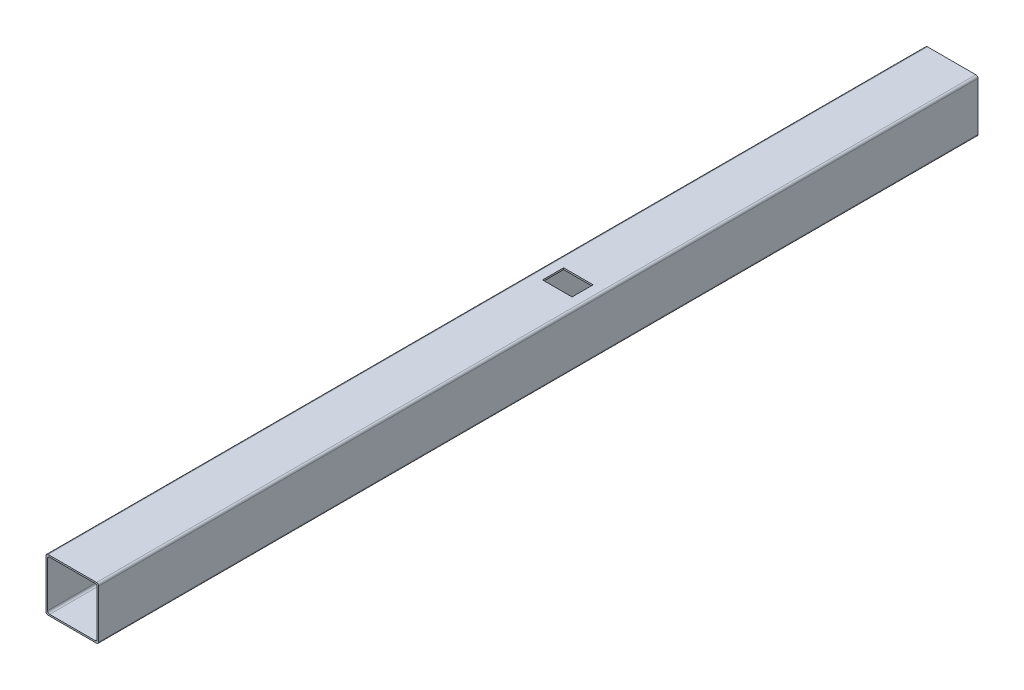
ISO-10303-21;
HEADER;
FILE_DESCRIPTION(('STEP AP214'),'2;1');
FILE_NAME('part.step','',(''),(''),'','','');
FILE_SCHEMA(('AUTOMOTIVE_DESIGN { 1 0 10303 214 1 1 1 1 }'));
ENDSEC;
DATA;
#1=APPLICATION_CONTEXT('core data for automotive mechanical design processes');
#2=APPLICATION_PROTOCOL_DEFINITION('international standard','automotive_design',2000,#1);
#3=PRODUCT_CONTEXT('',#1,'mechanical');
#4=PRODUCT('Part','Part','',(#3));
#5=PRODUCT_RELATED_PRODUCT_CATEGORY('part','',(#4));
#6=PRODUCT_DEFINITION_FORMATION('','',#4);
#7=PRODUCT_DEFINITION_CONTEXT('part definition',#1,'design');
#8=PRODUCT_DEFINITION('design','',#6,#7);
#9=PRODUCT_DEFINITION_SHAPE('','',#8);
#10=(LENGTH_UNIT() NAMED_UNIT(*) SI_UNIT(.MILLI.,.METRE.));
#11=(NAMED_UNIT(*) PLANE_ANGLE_UNIT() SI_UNIT($,.RADIAN.));
#12=(NAMED_UNIT(*) SI_UNIT($,.STERADIAN.) SOLID_ANGLE_UNIT());
#13=UNCERTAINTY_MEASURE_WITH_UNIT(LENGTH_MEASURE(1.E-05),#10,'distance_accuracy_value','');
#14=(GEOMETRIC_REPRESENTATION_CONTEXT(3) GLOBAL_UNCERTAINTY_ASSIGNED_CONTEXT((#13)) GLOBAL_UNIT_ASSIGNED_CONTEXT((#10,
#11,#12)) REPRESENTATION_CONTEXT('',''));
#15=CARTESIAN_POINT('',(0.,0.,0.));
#16=DIRECTION('',(0.,0.,1.));
#17=DIRECTION('',(1.,0.,0.));
#18=AXIS2_PLACEMENT_3D('',#15,#16,#17);
#19=CARTESIAN_POINT('',(0.,3.,1670.));
#20=DIRECTION('',(0.,1.,0.));
#21=DIRECTION('',(0.,0.,1.));
#22=AXIS2_PLACEMENT_3D('',#19,#20,#21);
#23=PLANE('',#22);
#24=DIRECTION('',(0.,0.,-1.));
#25=VECTOR('',#24,1.);
#26=CARTESIAN_POINT('',(7.,3.,1670.));
#27=LINE('',#26,#25);
#28=CARTESIAN_POINT('',(7.,3.,0.));
#29=VERTEX_POINT('',#28);
#30=CARTESIAN_POINT('',(7.00000000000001,3.,600.));
#31=VERTEX_POINT('',#30);
#32=EDGE_CURVE('E513',#29,#31,#27,.F.);
#33=ORIENTED_EDGE('',*,*,#32,.T.);
#34=DIRECTION('',(-1.,0.,0.));
#35=VECTOR('',#34,1.);
#36=CARTESIAN_POINT('',(95.,3.,600.));
#37=LINE('',#36,#35);
#38=CARTESIAN_POINT('',(93.,3.,600.));
#39=VERTEX_POINT('',#38);
#40=EDGE_CURVE('E346',#39,#31,#37,.T.);
#41=ORIENTED_EDGE('',*,*,#40,.F.);
#42=DIRECTION('',(0.,0.,-1.));
#43=VECTOR('',#42,1.);
#44=CARTESIAN_POINT('',(93.,3.,0.));
#45=LINE('',#44,#43);
#46=CARTESIAN_POINT('',(93.,3.,0.));
#47=VERTEX_POINT('',#46);
#48=EDGE_CURVE('E507',#39,#47,#45,.T.);
#49=ORIENTED_EDGE('',*,*,#48,.T.);
#50=DIRECTION('',(1.,0.,0.));
#51=VECTOR('',#50,1.);
#52=CARTESIAN_POINT('',(0.,3.,0.));
#53=LINE('',#52,#51);
#54=EDGE_CURVE('E409',#29,#47,#53,.T.);
#55=ORIENTED_EDGE('',*,*,#54,.F.);
#56=EDGE_LOOP('',(#33,#41,#49,#55));
#57=FACE_BOUND('',#56,.T.);
#58=ADVANCED_FACE('F66',(#57),#23,.T.);
#59=CARTESIAN_POINT('',(7.,7.00000000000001,1670.));
#60=DIRECTION('',(0.,0.,1.));
#61=DIRECTION('',(1.,0.,0.));
#62=AXIS2_PLACEMENT_3D('',#59,#60,#61);
#63=CYLINDRICAL_SURFACE('',#62,4.);
#64=CARTESIAN_POINT('',(7.,7.00000000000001,600.));
#65=DIRECTION('',(0.,0.,1.));
#66=DIRECTION('',(1.,0.,0.));
#67=AXIS2_PLACEMENT_3D('',#64,#65,#66);
#68=CIRCLE('',#67,4.);
#69=CARTESIAN_POINT('',(5.,3.53589838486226,600.));
#70=VERTEX_POINT('',#69);
#71=EDGE_CURVE('E342',#70,#31,#68,.T.);
#72=ORIENTED_EDGE('',*,*,#71,.T.);
#73=ORIENTED_EDGE('',*,*,#32,.F.);
#74=CARTESIAN_POINT('',(7.,7.00000000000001,0.));
#75=DIRECTION('',(0.,0.,1.));
#76=DIRECTION('',(1.,0.,0.));
#77=AXIS2_PLACEMENT_3D('',#74,#75,#76);
#78=CIRCLE('',#77,4.);
#79=CARTESIAN_POINT('',(3.,7.00000000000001,0.));
#80=VERTEX_POINT('',#79);
#81=EDGE_CURVE('E531',#80,#29,#78,.T.);
#82=ORIENTED_EDGE('',*,*,#81,.F.);
#83=DIRECTION('',(0.,0.,-1.));
#84=VECTOR('',#83,1.);
#85=CARTESIAN_POINT('',(3.,7.00000000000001,0.));
#86=LINE('',#85,#84);
#87=CARTESIAN_POINT('',(3.,7.00000000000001,1670.));
#88=VERTEX_POINT('',#87);
#89=EDGE_CURVE('E503',#88,#80,#86,.T.);
#90=ORIENTED_EDGE('',*,*,#89,.F.);
#91=CARTESIAN_POINT('',(7.,7.00000000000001,1670.));
#92=DIRECTION('',(0.,0.,1.));
#93=DIRECTION('',(1.,0.,0.));
#94=AXIS2_PLACEMENT_3D('',#91,#92,#93);
#95=CIRCLE('',#94,4.);
#96=CARTESIAN_POINT('',(7.,3.,1670.));
#97=VERTEX_POINT('',#96);
#98=EDGE_CURVE('E534',#97,#88,#95,.F.);
#99=ORIENTED_EDGE('',*,*,#98,.F.);
#100=CARTESIAN_POINT('',(7.00000000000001,3.,750.));
#101=VERTEX_POINT('',#100);
#102=EDGE_CURVE('E512',#101,#97,#27,.F.);
#103=ORIENTED_EDGE('',*,*,#102,.F.);
#104=CARTESIAN_POINT('',(7.,7.00000000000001,750.));
#105=DIRECTION('',(0.,0.,1.));
#106=DIRECTION('',(1.,0.,0.));
#107=AXIS2_PLACEMENT_3D('',#104,#105,#106);
#108=CIRCLE('',#107,4.);
#109=CARTESIAN_POINT('',(5.,3.53589838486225,750.));
#110=VERTEX_POINT('',#109);
#111=EDGE_CURVE('E385',#110,#101,#108,.T.);
#112=ORIENTED_EDGE('',*,*,#111,.F.);
#113=DIRECTION('',(0.,0.,1.));
#114=VECTOR('',#113,1.);
#115=CARTESIAN_POINT('',(4.99999999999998,3.53589838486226,1670.));
#116=LINE('',#115,#114);
#117=EDGE_CURVE('E338',#110,#70,#116,.F.);
#118=ORIENTED_EDGE('',*,*,#117,.T.);
#119=EDGE_LOOP('',(#72,#73,#82,#90,#99,#103,#112,#118));
#120=FACE_BOUND('',#119,.T.);
#121=ADVANCED_FACE('F588',(#120),#63,.F.);
#122=CARTESIAN_POINT('',(93.,7.,1670.));
#123=DIRECTION('',(0.,0.,1.));
#124=DIRECTION('',(1.,0.,0.));
#125=AXIS2_PLACEMENT_3D('',#122,#123,#124);
#126=CYLINDRICAL_SURFACE('',#125,4.);
#127=CARTESIAN_POINT('',(93.,7.,600.));
#128=DIRECTION('',(0.,0.,1.));
#129=DIRECTION('',(1.,0.,0.));
#130=AXIS2_PLACEMENT_3D('',#127,#128,#129);
#131=CIRCLE('',#130,4.);
#132=CARTESIAN_POINT('',(95.,3.53589838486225,600.));
#133=VERTEX_POINT('',#132);
#134=EDGE_CURVE('E334',#39,#133,#131,.T.);
#135=ORIENTED_EDGE('',*,*,#134,.T.);
#136=DIRECTION('',(0.,0.,1.));
#137=VECTOR('',#136,1.);
#138=CARTESIAN_POINT('',(95.,3.53589838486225,1670.));
#139=LINE('',#138,#137);
#140=CARTESIAN_POINT('',(95.,3.53589838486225,750.));
#141=VERTEX_POINT('',#140);
#142=EDGE_CURVE('E330',#141,#133,#139,.F.);
#143=ORIENTED_EDGE('',*,*,#142,.F.);
#144=CARTESIAN_POINT('',(93.,7.,750.));
#145=DIRECTION('',(0.,0.,1.));
#146=DIRECTION('',(1.,0.,0.));
#147=AXIS2_PLACEMENT_3D('',#144,#145,#146);
#148=CIRCLE('',#147,4.);
#149=CARTESIAN_POINT('',(93.,3.,750.));
#150=VERTEX_POINT('',#149);
#151=EDGE_CURVE('E368',#150,#141,#148,.T.);
#152=ORIENTED_EDGE('',*,*,#151,.F.);
#153=CARTESIAN_POINT('',(93.,3.,1670.));
#154=VERTEX_POINT('',#153);
#155=EDGE_CURVE('E508',#154,#150,#45,.T.);
#156=ORIENTED_EDGE('',*,*,#155,.F.);
#157=CARTESIAN_POINT('',(93.,7.,1670.));
#158=DIRECTION('',(0.,0.,1.));
#159=DIRECTION('',(1.,0.,0.));
#160=AXIS2_PLACEMENT_3D('',#157,#158,#159);
#161=CIRCLE('',#160,4.);
#162=CARTESIAN_POINT('',(97.,7.00000000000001,1670.));
#163=VERTEX_POINT('',#162);
#164=EDGE_CURVE('E539',#163,#154,#161,.F.);
#165=ORIENTED_EDGE('',*,*,#164,.F.);
#166=DIRECTION('',(0.,0.,-1.));
#167=VECTOR('',#166,1.);
#168=CARTESIAN_POINT('',(97.,7.,1670.));
#169=LINE('',#168,#167);
#170=CARTESIAN_POINT('',(97.,7.00000000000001,0.));
#171=VERTEX_POINT('',#170);
#172=EDGE_CURVE('E521',#171,#163,#169,.F.);
#173=ORIENTED_EDGE('',*,*,#172,.F.);
#174=CARTESIAN_POINT('',(93.,7.,0.));
#175=DIRECTION('',(0.,0.,1.));
#176=DIRECTION('',(1.,0.,0.));
#177=AXIS2_PLACEMENT_3D('',#174,#175,#176);
#178=CIRCLE('',#177,4.);
#179=EDGE_CURVE('E536',#47,#171,#178,.T.);
#180=ORIENTED_EDGE('',*,*,#179,.F.);
#181=ORIENTED_EDGE('',*,*,#48,.F.);
#182=EDGE_LOOP('',(#135,#143,#152,#156,#165,#173,#180,#181));
#183=FACE_BOUND('',#182,.T.);
#184=ADVANCED_FACE('F577',(#183),#126,.F.);
#185=CARTESIAN_POINT('',(0.,0.,1670.));
#186=DIRECTION('',(0.,0.,1.));
#187=DIRECTION('',(1.,0.,0.));
#188=AXIS2_PLACEMENT_3D('',#185,#186,#187);
#189=PLANE('',#188);
#190=DIRECTION('',(1.,0.,0.));
#191=VECTOR('',#190,1.);
#192=CARTESIAN_POINT('',(0.,0.,1670.));
#193=LINE('',#192,#191);
#194=CARTESIAN_POINT('',(4.,0.,1670.));
#195=VERTEX_POINT('',#194);
#196=CARTESIAN_POINT('',(96.,0.,1670.));
#197=VERTEX_POINT('',#196);
#198=EDGE_CURVE('E423',#195,#197,#193,.T.);
#199=ORIENTED_EDGE('',*,*,#198,.T.);
#200=CARTESIAN_POINT('',(96.,4.,1670.));
#201=DIRECTION('',(0.,0.,1.));
#202=DIRECTION('',(1.,0.,0.));
#203=AXIS2_PLACEMENT_3D('',#200,#201,#202);
#204=CIRCLE('',#203,4.);
#205=CARTESIAN_POINT('',(100.,4.,1670.));
#206=VERTEX_POINT('',#205);
#207=EDGE_CURVE('E483',#197,#206,#204,.T.);
#208=ORIENTED_EDGE('',*,*,#207,.T.);
#209=DIRECTION('',(0.,1.,0.));
#210=VECTOR('',#209,1.);
#211=CARTESIAN_POINT('',(100.,0.,1670.));
#212=LINE('',#211,#210);
#213=CARTESIAN_POINT('',(100.,96.,1670.));
#214=VERTEX_POINT('',#213);
#215=EDGE_CURVE('E428',#206,#214,#212,.T.);
#216=ORIENTED_EDGE('',*,*,#215,.T.);
#217=CARTESIAN_POINT('',(96.,96.,1670.));
#218=DIRECTION('',(0.,0.,1.));
#219=DIRECTION('',(1.,0.,0.));
#220=AXIS2_PLACEMENT_3D('',#217,#218,#219);
#221=CIRCLE('',#220,4.);
#222=CARTESIAN_POINT('',(96.,100.,1670.));
#223=VERTEX_POINT('',#222);
#224=EDGE_CURVE('E476',#214,#223,#221,.T.);
#225=ORIENTED_EDGE('',*,*,#224,.T.);
#226=DIRECTION('',(-1.,0.,0.));
#227=VECTOR('',#226,1.);
#228=CARTESIAN_POINT('',(0.,100.,1670.));
#229=LINE('',#228,#227);
#230=CARTESIAN_POINT('',(4.,100.,1670.));
#231=VERTEX_POINT('',#230);
#232=EDGE_CURVE('E432',#223,#231,#229,.T.);
#233=ORIENTED_EDGE('',*,*,#232,.T.);
#234=CARTESIAN_POINT('',(4.,96.,1670.));
#235=DIRECTION('',(0.,0.,1.));
#236=DIRECTION('',(1.,0.,0.));
#237=AXIS2_PLACEMENT_3D('',#234,#235,#236);
#238=CIRCLE('',#237,4.);
#239=CARTESIAN_POINT('',(0.,96.,1670.));
#240=VERTEX_POINT('',#239);
#241=EDGE_CURVE('E479',#231,#240,#238,.T.);
#242=ORIENTED_EDGE('',*,*,#241,.T.);
#243=DIRECTION('',(0.,-1.,0.));
#244=VECTOR('',#243,1.);
#245=CARTESIAN_POINT('',(0.,0.,1670.));
#246=LINE('',#245,#244);
#247=CARTESIAN_POINT('',(0.,4.,1670.));
#248=VERTEX_POINT('',#247);
#249=EDGE_CURVE('E420',#240,#248,#246,.T.);
#250=ORIENTED_EDGE('',*,*,#249,.T.);
#251=CARTESIAN_POINT('',(4.,4.,1670.));
#252=DIRECTION('',(0.,0.,1.));
#253=DIRECTION('',(1.,0.,0.));
#254=AXIS2_PLACEMENT_3D('',#251,#252,#253);
#255=CIRCLE('',#254,4.);
#256=EDGE_CURVE('E481',#248,#195,#255,.T.);
#257=ORIENTED_EDGE('',*,*,#256,.T.);
#258=EDGE_LOOP('',(#199,#208,#216,#225,#233,#242,#250,#257));
#259=FACE_BOUND('',#258,.T.);
#260=DIRECTION('',(1.,0.,0.));
#261=VECTOR('',#260,1.);
#262=CARTESIAN_POINT('',(0.,3.,1670.));
#263=LINE('',#262,#261);
#264=EDGE_CURVE('E392',#97,#154,#263,.T.);
#265=ORIENTED_EDGE('',*,*,#264,.F.);
#266=ORIENTED_EDGE('',*,*,#98,.T.);
#267=DIRECTION('',(0.,-1.,0.));
#268=VECTOR('',#267,1.);
#269=CARTESIAN_POINT('',(3.,100.,1670.));
#270=LINE('',#269,#268);
#271=CARTESIAN_POINT('',(3.,93.,1670.));
#272=VERTEX_POINT('',#271);
#273=EDGE_CURVE('E389',#272,#88,#270,.T.);
#274=ORIENTED_EDGE('',*,*,#273,.F.);
#275=CARTESIAN_POINT('',(7.,93.,1670.));
#276=DIRECTION('',(0.,0.,1.));
#277=DIRECTION('',(1.,0.,0.));
#278=AXIS2_PLACEMENT_3D('',#275,#276,#277);
#279=CIRCLE('',#278,4.);
#280=CARTESIAN_POINT('',(7.,97.,1670.));
#281=VERTEX_POINT('',#280);
#282=EDGE_CURVE('E12',#272,#281,#279,.F.);
#283=ORIENTED_EDGE('',*,*,#282,.T.);
#284=DIRECTION('',(-1.,0.,0.));
#285=VECTOR('',#284,1.);
#286=CARTESIAN_POINT('',(0.,97.,1670.));
#287=LINE('',#286,#285);
#288=CARTESIAN_POINT('',(93.,97.,1670.));
#289=VERTEX_POINT('',#288);
#290=EDGE_CURVE('E401',#289,#281,#287,.T.);
#291=ORIENTED_EDGE('',*,*,#290,.F.);
#292=CARTESIAN_POINT('',(93.,93.,1670.));
#293=DIRECTION('',(0.,0.,1.));
#294=DIRECTION('',(1.,0.,0.));
#295=AXIS2_PLACEMENT_3D('',#292,#293,#294);
#296=CIRCLE('',#295,4.);
#297=CARTESIAN_POINT('',(97.,93.,1670.));
#298=VERTEX_POINT('',#297);
#299=EDGE_CURVE('E545',#289,#298,#296,.F.);
#300=ORIENTED_EDGE('',*,*,#299,.T.);
#301=DIRECTION('',(0.,1.,0.));
#302=VECTOR('',#301,1.);
#303=CARTESIAN_POINT('',(97.,100.,1670.));
#304=LINE('',#303,#302);
#305=EDGE_CURVE('E397',#163,#298,#304,.T.);
#306=ORIENTED_EDGE('',*,*,#305,.F.);
#307=ORIENTED_EDGE('',*,*,#164,.T.);
#308=EDGE_LOOP('',(#265,#266,#274,#283,#291,#300,#306,#307));
#309=FACE_BOUND('',#308,.T.);
#310=ADVANCED_FACE('F563',(#259,#309),#189,.T.);
#311=CARTESIAN_POINT('',(0.,0.,0.));
#312=DIRECTION('',(0.,0.,1.));
#313=DIRECTION('',(1.,0.,0.));
#314=AXIS2_PLACEMENT_3D('',#311,#312,#313);
#315=PLANE('',#314);
#316=DIRECTION('',(0.,1.,0.));
#317=VECTOR('',#316,1.);
#318=CARTESIAN_POINT('',(100.,0.,0.));
#319=LINE('',#318,#317);
#320=CARTESIAN_POINT('',(100.,4.,0.));
#321=VERTEX_POINT('',#320);
#322=CARTESIAN_POINT('',(100.,96.,0.));
#323=VERTEX_POINT('',#322);
#324=EDGE_CURVE('E444',#321,#323,#319,.T.);
#325=ORIENTED_EDGE('',*,*,#324,.F.);
#326=CARTESIAN_POINT('',(96.,4.,0.));
#327=DIRECTION('',(0.,0.,1.));
#328=DIRECTION('',(1.,0.,0.));
#329=AXIS2_PLACEMENT_3D('',#326,#327,#328);
#330=CIRCLE('',#329,4.);
#331=CARTESIAN_POINT('',(96.,0.,0.));
#332=VERTEX_POINT('',#331);
#333=EDGE_CURVE('E466',#321,#332,#330,.F.);
#334=ORIENTED_EDGE('',*,*,#333,.T.);
#335=DIRECTION('',(1.,0.,0.));
#336=VECTOR('',#335,1.);
#337=CARTESIAN_POINT('',(0.,0.,0.));
#338=LINE('',#337,#336);
#339=CARTESIAN_POINT('',(4.,0.,0.));
#340=VERTEX_POINT('',#339);
#341=EDGE_CURVE('E440',#340,#332,#338,.T.);
#342=ORIENTED_EDGE('',*,*,#341,.F.);
#343=CARTESIAN_POINT('',(4.,4.,0.));
#344=DIRECTION('',(0.,0.,1.));
#345=DIRECTION('',(1.,0.,0.));
#346=AXIS2_PLACEMENT_3D('',#343,#344,#345);
#347=CIRCLE('',#346,4.);
#348=CARTESIAN_POINT('',(0.,4.,0.));
#349=VERTEX_POINT('',#348);
#350=EDGE_CURVE('E463',#340,#349,#347,.F.);
#351=ORIENTED_EDGE('',*,*,#350,.T.);
#352=DIRECTION('',(0.,-1.,0.));
#353=VECTOR('',#352,1.);
#354=CARTESIAN_POINT('',(0.,0.,0.));
#355=LINE('',#354,#353);
#356=CARTESIAN_POINT('',(0.,96.,0.));
#357=VERTEX_POINT('',#356);
#358=EDGE_CURVE('E405',#357,#349,#355,.T.);
#359=ORIENTED_EDGE('',*,*,#358,.F.);
#360=CARTESIAN_POINT('',(4.,96.,0.));
#361=DIRECTION('',(0.,0.,1.));
#362=DIRECTION('',(1.,0.,0.));
#363=AXIS2_PLACEMENT_3D('',#360,#361,#362);
#364=CIRCLE('',#363,4.);
#365=CARTESIAN_POINT('',(4.,100.,0.));
#366=VERTEX_POINT('',#365);
#367=EDGE_CURVE('E460',#357,#366,#364,.F.);
#368=ORIENTED_EDGE('',*,*,#367,.T.);
#369=DIRECTION('',(-1.,0.,0.));
#370=VECTOR('',#369,1.);
#371=CARTESIAN_POINT('',(0.,100.,0.));
#372=LINE('',#371,#370);
#373=CARTESIAN_POINT('',(96.,100.,0.));
#374=VERTEX_POINT('',#373);
#375=EDGE_CURVE('E424',#374,#366,#372,.T.);
#376=ORIENTED_EDGE('',*,*,#375,.F.);
#377=CARTESIAN_POINT('',(96.,96.,0.));
#378=DIRECTION('',(0.,0.,1.));
#379=DIRECTION('',(1.,0.,0.));
#380=AXIS2_PLACEMENT_3D('',#377,#378,#379);
#381=CIRCLE('',#380,4.);
#382=EDGE_CURVE('E457',#374,#323,#381,.F.);
#383=ORIENTED_EDGE('',*,*,#382,.T.);
#384=EDGE_LOOP('',(#325,#334,#342,#351,#359,#368,#376,#383));
#385=FACE_BOUND('',#384,.T.);
#386=DIRECTION('',(-1.,0.,0.));
#387=VECTOR('',#386,1.);
#388=CARTESIAN_POINT('',(0.,97.,0.));
#389=LINE('',#388,#387);
#390=CARTESIAN_POINT('',(93.,97.,0.));
#391=VERTEX_POINT('',#390);
#392=CARTESIAN_POINT('',(7.,97.,0.));
#393=VERTEX_POINT('',#392);
#394=EDGE_CURVE('E393',#391,#393,#389,.T.);
#395=ORIENTED_EDGE('',*,*,#394,.T.);
#396=CARTESIAN_POINT('',(7.,93.,0.));
#397=DIRECTION('',(0.,0.,1.));
#398=DIRECTION('',(1.,0.,0.));
#399=AXIS2_PLACEMENT_3D('',#396,#397,#398);
#400=CIRCLE('',#399,4.);
#401=CARTESIAN_POINT('',(3.,93.,0.));
#402=VERTEX_POINT('',#401);
#403=EDGE_CURVE('E74',#393,#402,#400,.T.);
#404=ORIENTED_EDGE('',*,*,#403,.T.);
#405=DIRECTION('',(0.,-1.,0.));
#406=VECTOR('',#405,1.);
#407=CARTESIAN_POINT('',(3.,100.,0.));
#408=LINE('',#407,#406);
#409=EDGE_CURVE('E388',#402,#80,#408,.T.);
#410=ORIENTED_EDGE('',*,*,#409,.T.);
#411=ORIENTED_EDGE('',*,*,#81,.T.);
#412=ORIENTED_EDGE('',*,*,#54,.T.);
#413=ORIENTED_EDGE('',*,*,#179,.T.);
#414=DIRECTION('',(0.,1.,0.));
#415=VECTOR('',#414,1.);
#416=CARTESIAN_POINT('',(97.,100.,0.));
#417=LINE('',#416,#415);
#418=CARTESIAN_POINT('',(97.,93.,0.));
#419=VERTEX_POINT('',#418);
#420=EDGE_CURVE('E413',#171,#419,#417,.T.);
#421=ORIENTED_EDGE('',*,*,#420,.T.);
#422=CARTESIAN_POINT('',(93.,93.,0.));
#423=DIRECTION('',(0.,0.,1.));
#424=DIRECTION('',(1.,0.,0.));
#425=AXIS2_PLACEMENT_3D('',#422,#423,#424);
#426=CIRCLE('',#425,4.);
#427=EDGE_CURVE('E542',#419,#391,#426,.T.);
#428=ORIENTED_EDGE('',*,*,#427,.T.);
#429=EDGE_LOOP('',(#395,#404,#410,#411,#412,#413,#421,#428));
#430=FACE_BOUND('',#429,.T.);
#431=ADVANCED_FACE('F550',(#385,#430),#315,.F.);
#432=CARTESIAN_POINT('',(0.,0.,1670.));
#433=DIRECTION('',(1.,0.,0.));
#434=DIRECTION('',(0.,0.,-1.));
#435=AXIS2_PLACEMENT_3D('',#432,#433,#434);
#436=PLANE('',#435);
#437=ORIENTED_EDGE('',*,*,#358,.T.);
#438=DIRECTION('',(0.,0.,-1.));
#439=VECTOR('',#438,1.);
#440=CARTESIAN_POINT('',(0.,4.,1670.));
#441=LINE('',#440,#439);
#442=EDGE_CURVE('E490',#349,#248,#441,.F.);
#443=ORIENTED_EDGE('',*,*,#442,.T.);
#444=ORIENTED_EDGE('',*,*,#249,.F.);
#445=DIRECTION('',(0.,0.,-1.));
#446=VECTOR('',#445,1.);
#447=CARTESIAN_POINT('',(0.,96.,1670.));
#448=LINE('',#447,#446);
#449=EDGE_CURVE('E486',#240,#357,#448,.T.);
#450=ORIENTED_EDGE('',*,*,#449,.T.);
#451=EDGE_LOOP('',(#437,#443,#444,#450));
#452=FACE_BOUND('',#451,.T.);
#453=ADVANCED_FACE('F615',(#452),#436,.F.);
#454=CARTESIAN_POINT('',(0.,0.,1670.));
#455=DIRECTION('',(0.,1.,0.));
#456=DIRECTION('',(0.,0.,1.));
#457=AXIS2_PLACEMENT_3D('',#454,#455,#456);
#458=PLANE('',#457);
#459=DIRECTION('',(-1.,0.,0.));
#460=VECTOR('',#459,1.);
#461=CARTESIAN_POINT('',(95.,0.,750.));
#462=LINE('',#461,#460);
#463=CARTESIAN_POINT('',(95.,0.,750.));
#464=VERTEX_POINT('',#463);
#465=CARTESIAN_POINT('',(5.,0.,750.));
#466=VERTEX_POINT('',#465);
#467=EDGE_CURVE('E352',#464,#466,#462,.T.);
#468=ORIENTED_EDGE('',*,*,#467,.F.);
#469=DIRECTION('',(0.,0.,1.));
#470=VECTOR('',#469,1.);
#471=CARTESIAN_POINT('',(95.,0.,600.));
#472=LINE('',#471,#470);
#473=CARTESIAN_POINT('',(95.,0.,600.));
#474=VERTEX_POINT('',#473);
#475=EDGE_CURVE('E349',#474,#464,#472,.T.);
#476=ORIENTED_EDGE('',*,*,#475,.F.);
#477=DIRECTION('',(-1.,0.,0.));
#478=VECTOR('',#477,1.);
#479=CARTESIAN_POINT('',(95.,0.,600.));
#480=LINE('',#479,#478);
#481=CARTESIAN_POINT('',(5.,0.,600.));
#482=VERTEX_POINT('',#481);
#483=EDGE_CURVE('E360',#474,#482,#480,.T.);
#484=ORIENTED_EDGE('',*,*,#483,.T.);
#485=DIRECTION('',(0.,0.,1.));
#486=VECTOR('',#485,1.);
#487=CARTESIAN_POINT('',(5.,0.,600.));
#488=LINE('',#487,#486);
#489=EDGE_CURVE('E356',#482,#466,#488,.T.);
#490=ORIENTED_EDGE('',*,*,#489,.T.);
#491=EDGE_LOOP('',(#468,#476,#484,#490));
#492=FACE_BOUND('',#491,.T.);
#493=ORIENTED_EDGE('',*,*,#341,.T.);
#494=DIRECTION('',(0.,0.,-1.));
#495=VECTOR('',#494,1.);
#496=CARTESIAN_POINT('',(96.,0.,1670.));
#497=LINE('',#496,#495);
#498=EDGE_CURVE('E473',#332,#197,#497,.F.);
#499=ORIENTED_EDGE('',*,*,#498,.T.);
#500=ORIENTED_EDGE('',*,*,#198,.F.);
#501=DIRECTION('',(0.,0.,-1.));
#502=VECTOR('',#501,1.);
#503=CARTESIAN_POINT('',(4.,0.,1670.));
#504=LINE('',#503,#502);
#505=EDGE_CURVE('E469',#195,#340,#504,.T.);
#506=ORIENTED_EDGE('',*,*,#505,.T.);
#507=EDGE_LOOP('',(#493,#499,#500,#506));
#508=FACE_BOUND('',#507,.T.);
#509=ADVANCED_FACE('F611',(#492,#508),#458,.F.);
#510=CARTESIAN_POINT('',(100.,0.,1670.));
#511=DIRECTION('',(-1.,0.,0.));
#512=DIRECTION('',(0.,0.,1.));
#513=AXIS2_PLACEMENT_3D('',#510,#511,#512);
#514=PLANE('',#513);
#515=ORIENTED_EDGE('',*,*,#215,.F.);
#516=DIRECTION('',(0.,0.,-1.));
#517=VECTOR('',#516,1.);
#518=CARTESIAN_POINT('',(100.,4.,1670.));
#519=LINE('',#518,#517);
#520=EDGE_CURVE('E453',#206,#321,#519,.T.);
#521=ORIENTED_EDGE('',*,*,#520,.T.);
#522=ORIENTED_EDGE('',*,*,#324,.T.);
#523=DIRECTION('',(0.,0.,-1.));
#524=VECTOR('',#523,1.);
#525=CARTESIAN_POINT('',(100.,96.,1670.));
#526=LINE('',#525,#524);
#527=EDGE_CURVE('E436',#323,#214,#526,.F.);
#528=ORIENTED_EDGE('',*,*,#527,.T.);
#529=EDGE_LOOP('',(#515,#521,#522,#528));
#530=FACE_BOUND('',#529,.T.);
#531=ADVANCED_FACE('F614',(#530),#514,.F.);
#532=CARTESIAN_POINT('',(0.,100.,1670.));
#533=DIRECTION('',(0.,-1.,0.));
#534=DIRECTION('',(0.,0.,-1.));
#535=AXIS2_PLACEMENT_3D('',#532,#533,#534);
#536=PLANE('',#535);
#537=DIRECTION('',(-1.,0.,0.));
#538=VECTOR('',#537,1.);
#539=CARTESIAN_POINT('',(0.,100.,749.));
#540=LINE('',#539,#538);
#541=CARTESIAN_POINT('',(78.,100.,749.));
#542=VERTEX_POINT('',#541);
#543=CARTESIAN_POINT('',(22.,100.,749.));
#544=VERTEX_POINT('',#543);
#545=EDGE_CURVE('E322',#542,#544,#540,.T.);
#546=ORIENTED_EDGE('',*,*,#545,.T.);
#547=DIRECTION('',(0.,0.,-1.));
#548=VECTOR('',#547,1.);
#549=CARTESIAN_POINT('',(22.,100.,1670.));
#550=LINE('',#549,#548);
#551=CARTESIAN_POINT('',(22.,100.,709.));
#552=VERTEX_POINT('',#551);
#553=EDGE_CURVE('E326',#544,#552,#550,.T.);
#554=ORIENTED_EDGE('',*,*,#553,.T.);
#555=DIRECTION('',(1.,0.,0.));
#556=VECTOR('',#555,1.);
#557=CARTESIAN_POINT('',(0.,100.,709.));
#558=LINE('',#557,#556);
#559=CARTESIAN_POINT('',(78.,100.,709.));
#560=VERTEX_POINT('',#559);
#561=EDGE_CURVE('E314',#552,#560,#558,.T.);
#562=ORIENTED_EDGE('',*,*,#561,.T.);
#563=DIRECTION('',(0.,0.,1.));
#564=VECTOR('',#563,1.);
#565=CARTESIAN_POINT('',(78.,100.,1670.));
#566=LINE('',#565,#564);
#567=EDGE_CURVE('E288',#560,#542,#566,.T.);
#568=ORIENTED_EDGE('',*,*,#567,.T.);
#569=EDGE_LOOP('',(#546,#554,#562,#568));
#570=FACE_BOUND('',#569,.T.);
#571=ORIENTED_EDGE('',*,*,#375,.T.);
#572=DIRECTION('',(0.,0.,-1.));
#573=VECTOR('',#572,1.);
#574=CARTESIAN_POINT('',(4.,100.,1670.));
#575=LINE('',#574,#573);
#576=EDGE_CURVE('E497',#366,#231,#575,.F.);
#577=ORIENTED_EDGE('',*,*,#576,.T.);
#578=ORIENTED_EDGE('',*,*,#232,.F.);
#579=DIRECTION('',(0.,0.,-1.));
#580=VECTOR('',#579,1.);
#581=CARTESIAN_POINT('',(96.,100.,1670.));
#582=LINE('',#581,#580);
#583=EDGE_CURVE('E493',#223,#374,#582,.T.);
#584=ORIENTED_EDGE('',*,*,#583,.T.);
#585=EDGE_LOOP('',(#571,#577,#578,#584));
#586=FACE_BOUND('',#585,.T.);
#587=ADVANCED_FACE('F638',(#570,#586),#536,.F.);
#588=CARTESIAN_POINT('',(3.,100.,1670.));
#589=DIRECTION('',(1.,0.,0.));
#590=DIRECTION('',(0.,0.,-1.));
#591=AXIS2_PLACEMENT_3D('',#588,#589,#590);
#592=PLANE('',#591);
#593=ORIENTED_EDGE('',*,*,#273,.T.);
#594=ORIENTED_EDGE('',*,*,#89,.T.);
#595=ORIENTED_EDGE('',*,*,#409,.F.);
#596=DIRECTION('',(0.,0.,-1.));
#597=VECTOR('',#596,1.);
#598=CARTESIAN_POINT('',(3.,93.,1670.));
#599=LINE('',#598,#597);
#600=EDGE_CURVE('E500',#402,#272,#599,.F.);
#601=ORIENTED_EDGE('',*,*,#600,.T.);
#602=EDGE_LOOP('',(#593,#594,#595,#601));
#603=FACE_BOUND('',#602,.T.);
#604=ADVANCED_FACE('F556',(#603),#592,.T.);
#605=DIRECTION('',(-1.,0.,0.));
#606=VECTOR('',#605,1.);
#607=CARTESIAN_POINT('',(95.,3.,750.));
#608=LINE('',#607,#606);
#609=EDGE_CURVE('E381',#150,#101,#608,.T.);
#610=ORIENTED_EDGE('',*,*,#609,.T.);
#611=ORIENTED_EDGE('',*,*,#102,.T.);
#612=ORIENTED_EDGE('',*,*,#264,.T.);
#613=ORIENTED_EDGE('',*,*,#155,.T.);
#614=EDGE_LOOP('',(#610,#611,#612,#613));
#615=FACE_BOUND('',#614,.T.);
#616=ADVANCED_FACE('F583',(#615),#23,.T.);
#617=CARTESIAN_POINT('',(97.,100.,1670.));
#618=DIRECTION('',(-1.,0.,0.));
#619=DIRECTION('',(0.,0.,1.));
#620=AXIS2_PLACEMENT_3D('',#617,#618,#619);
#621=PLANE('',#620);
#622=ORIENTED_EDGE('',*,*,#420,.F.);
#623=ORIENTED_EDGE('',*,*,#172,.T.);
#624=ORIENTED_EDGE('',*,*,#305,.T.);
#625=DIRECTION('',(0.,0.,-1.));
#626=VECTOR('',#625,1.);
#627=CARTESIAN_POINT('',(97.,93.,0.));
#628=LINE('',#627,#626);
#629=EDGE_CURVE('E517',#298,#419,#628,.T.);
#630=ORIENTED_EDGE('',*,*,#629,.T.);
#631=EDGE_LOOP('',(#622,#623,#624,#630));
#632=FACE_BOUND('',#631,.T.);
#633=ADVANCED_FACE('F573',(#632),#621,.T.);
#634=CARTESIAN_POINT('',(0.,97.,1670.));
#635=DIRECTION('',(0.,-1.,0.));
#636=DIRECTION('',(0.,0.,-1.));
#637=AXIS2_PLACEMENT_3D('',#634,#635,#636);
#638=PLANE('',#637);
#639=DIRECTION('',(0.,0.,-1.));
#640=VECTOR('',#639,1.);
#641=CARTESIAN_POINT('',(22.,97.,749.));
#642=LINE('',#641,#640);
#643=CARTESIAN_POINT('',(22.,97.,749.));
#644=VERTEX_POINT('',#643);
#645=CARTESIAN_POINT('',(22.,97.,709.));
#646=VERTEX_POINT('',#645);
#647=EDGE_CURVE('E95',#644,#646,#642,.T.);
#648=ORIENTED_EDGE('',*,*,#647,.F.);
#649=DIRECTION('',(-1.,0.,0.));
#650=VECTOR('',#649,1.);
#651=CARTESIAN_POINT('',(22.,97.,749.));
#652=LINE('',#651,#650);
#653=CARTESIAN_POINT('',(78.,97.,749.));
#654=VERTEX_POINT('',#653);
#655=EDGE_CURVE('E303',#654,#644,#652,.T.);
#656=ORIENTED_EDGE('',*,*,#655,.F.);
#657=DIRECTION('',(0.,0.,1.));
#658=VECTOR('',#657,1.);
#659=CARTESIAN_POINT('',(78.,97.,749.));
#660=LINE('',#659,#658);
#661=CARTESIAN_POINT('',(78.,97.,709.));
#662=VERTEX_POINT('',#661);
#663=EDGE_CURVE('E285',#662,#654,#660,.T.);
#664=ORIENTED_EDGE('',*,*,#663,.F.);
#665=DIRECTION('',(1.,0.,0.));
#666=VECTOR('',#665,1.);
#667=CARTESIAN_POINT('',(22.,97.,709.));
#668=LINE('',#667,#666);
#669=EDGE_CURVE('E295',#646,#662,#668,.T.);
#670=ORIENTED_EDGE('',*,*,#669,.F.);
#671=EDGE_LOOP('',(#648,#656,#664,#670));
#672=FACE_BOUND('',#671,.T.);
#673=ORIENTED_EDGE('',*,*,#394,.F.);
#674=DIRECTION('',(0.,0.,-1.));
#675=VECTOR('',#674,1.);
#676=CARTESIAN_POINT('',(93.,97.,1670.));
#677=LINE('',#676,#675);
#678=EDGE_CURVE('E528',#391,#289,#677,.F.);
#679=ORIENTED_EDGE('',*,*,#678,.T.);
#680=ORIENTED_EDGE('',*,*,#290,.T.);
#681=DIRECTION('',(0.,0.,-1.));
#682=VECTOR('',#681,1.);
#683=CARTESIAN_POINT('',(7.,97.,0.));
#684=LINE('',#683,#682);
#685=EDGE_CURVE('E524',#281,#393,#684,.T.);
#686=ORIENTED_EDGE('',*,*,#685,.T.);
#687=EDGE_LOOP('',(#673,#679,#680,#686));
#688=FACE_BOUND('',#687,.T.);
#689=ADVANCED_FACE('F300',(#672,#688),#638,.T.);
#690=CARTESIAN_POINT('',(96.,4.,1670.));
#691=DIRECTION('',(0.,0.,-1.));
#692=DIRECTION('',(-1.,0.,0.));
#693=AXIS2_PLACEMENT_3D('',#690,#691,#692);
#694=CYLINDRICAL_SURFACE('',#693,4.);
#695=ORIENTED_EDGE('',*,*,#207,.F.);
#696=ORIENTED_EDGE('',*,*,#498,.F.);
#697=ORIENTED_EDGE('',*,*,#333,.F.);
#698=ORIENTED_EDGE('',*,*,#520,.F.);
#699=EDGE_LOOP('',(#695,#696,#697,#698));
#700=FACE_BOUND('',#699,.T.);
#701=ADVANCED_FACE('F624',(#700),#694,.T.);
#702=CARTESIAN_POINT('',(4.,4.,1670.));
#703=DIRECTION('',(0.,0.,-1.));
#704=DIRECTION('',(-1.,0.,0.));
#705=AXIS2_PLACEMENT_3D('',#702,#703,#704);
#706=CYLINDRICAL_SURFACE('',#705,4.);
#707=ORIENTED_EDGE('',*,*,#256,.F.);
#708=ORIENTED_EDGE('',*,*,#442,.F.);
#709=ORIENTED_EDGE('',*,*,#350,.F.);
#710=ORIENTED_EDGE('',*,*,#505,.F.);
#711=EDGE_LOOP('',(#707,#708,#709,#710));
#712=FACE_BOUND('',#711,.T.);
#713=ADVANCED_FACE('F650',(#712),#706,.T.);
#714=CARTESIAN_POINT('',(4.,96.,1670.));
#715=DIRECTION('',(0.,0.,-1.));
#716=DIRECTION('',(-1.,0.,0.));
#717=AXIS2_PLACEMENT_3D('',#714,#715,#716);
#718=CYLINDRICAL_SURFACE('',#717,4.);
#719=ORIENTED_EDGE('',*,*,#241,.F.);
#720=ORIENTED_EDGE('',*,*,#576,.F.);
#721=ORIENTED_EDGE('',*,*,#367,.F.);
#722=ORIENTED_EDGE('',*,*,#449,.F.);
#723=EDGE_LOOP('',(#719,#720,#721,#722));
#724=FACE_BOUND('',#723,.T.);
#725=ADVANCED_FACE('F642',(#724),#718,.T.);
#726=CARTESIAN_POINT('',(96.,96.,1670.));
#727=DIRECTION('',(0.,0.,-1.));
#728=DIRECTION('',(-1.,0.,0.));
#729=AXIS2_PLACEMENT_3D('',#726,#727,#728);
#730=CYLINDRICAL_SURFACE('',#729,4.);
#731=ORIENTED_EDGE('',*,*,#224,.F.);
#732=ORIENTED_EDGE('',*,*,#527,.F.);
#733=ORIENTED_EDGE('',*,*,#382,.F.);
#734=ORIENTED_EDGE('',*,*,#583,.F.);
#735=EDGE_LOOP('',(#731,#732,#733,#734));
#736=FACE_BOUND('',#735,.T.);
#737=ADVANCED_FACE('F633',(#736),#730,.T.);
#738=CARTESIAN_POINT('',(93.,93.,1670.));
#739=DIRECTION('',(0.,0.,1.));
#740=DIRECTION('',(1.,0.,0.));
#741=AXIS2_PLACEMENT_3D('',#738,#739,#740);
#742=CYLINDRICAL_SURFACE('',#741,4.);
#743=ORIENTED_EDGE('',*,*,#299,.F.);
#744=ORIENTED_EDGE('',*,*,#678,.F.);
#745=ORIENTED_EDGE('',*,*,#427,.F.);
#746=ORIENTED_EDGE('',*,*,#629,.F.);
#747=EDGE_LOOP('',(#743,#744,#745,#746));
#748=FACE_BOUND('',#747,.T.);
#749=ADVANCED_FACE('F567',(#748),#742,.F.);
#750=CARTESIAN_POINT('',(7.,93.,1670.));
#751=DIRECTION('',(0.,0.,1.));
#752=DIRECTION('',(1.,0.,0.));
#753=AXIS2_PLACEMENT_3D('',#750,#751,#752);
#754=CYLINDRICAL_SURFACE('',#753,4.);
#755=ORIENTED_EDGE('',*,*,#282,.F.);
#756=ORIENTED_EDGE('',*,*,#600,.F.);
#757=ORIENTED_EDGE('',*,*,#403,.F.);
#758=ORIENTED_EDGE('',*,*,#685,.F.);
#759=EDGE_LOOP('',(#755,#756,#757,#758));
#760=FACE_BOUND('',#759,.T.);
#761=ADVANCED_FACE('F68',(#760),#754,.F.);
#762=CARTESIAN_POINT('',(95.,100.001,600.));
#763=DIRECTION('',(1.,0.,0.));
#764=DIRECTION('',(0.,0.,-1.));
#765=AXIS2_PLACEMENT_3D('',#762,#763,#764);
#766=PLANE('',#765);
#767=ORIENTED_EDGE('',*,*,#142,.T.);
#768=DIRECTION('',(0.,-1.,0.));
#769=VECTOR('',#768,1.);
#770=CARTESIAN_POINT('',(95.,100.001,600.));
#771=LINE('',#770,#769);
#772=EDGE_CURVE('E365',#133,#474,#771,.T.);
#773=ORIENTED_EDGE('',*,*,#772,.T.);
#774=ORIENTED_EDGE('',*,*,#475,.T.);
#775=DIRECTION('',(0.,-1.,0.));
#776=VECTOR('',#775,1.);
#777=CARTESIAN_POINT('',(95.,100.001,750.));
#778=LINE('',#777,#776);
#779=EDGE_CURVE('E364',#141,#464,#778,.T.);
#780=ORIENTED_EDGE('',*,*,#779,.F.);
#781=EDGE_LOOP('',(#767,#773,#774,#780));
#782=FACE_BOUND('',#781,.T.);
#783=ADVANCED_FACE('F602',(#782),#766,.F.);
#784=CARTESIAN_POINT('',(95.,100.001,600.));
#785=DIRECTION('',(0.,0.,1.));
#786=DIRECTION('',(1.,0.,0.));
#787=AXIS2_PLACEMENT_3D('',#784,#785,#786);
#788=PLANE('',#787);
#789=DIRECTION('',(0.,-1.,0.));
#790=VECTOR('',#789,1.);
#791=CARTESIAN_POINT('',(5.,100.001,600.));
#792=LINE('',#791,#790);
#793=EDGE_CURVE('E369',#70,#482,#792,.T.);
#794=ORIENTED_EDGE('',*,*,#793,.T.);
#795=ORIENTED_EDGE('',*,*,#483,.F.);
#796=ORIENTED_EDGE('',*,*,#772,.F.);
#797=ORIENTED_EDGE('',*,*,#134,.F.);
#798=ORIENTED_EDGE('',*,*,#40,.T.);
#799=ORIENTED_EDGE('',*,*,#71,.F.);
#800=EDGE_LOOP('',(#794,#795,#796,#797,#798,#799));
#801=FACE_BOUND('',#800,.T.);
#802=ADVANCED_FACE('F597',(#801),#788,.T.);
#803=CARTESIAN_POINT('',(5.,100.001,600.));
#804=DIRECTION('',(1.,0.,0.));
#805=DIRECTION('',(0.,0.,-1.));
#806=AXIS2_PLACEMENT_3D('',#803,#804,#805);
#807=PLANE('',#806);
#808=DIRECTION('',(0.,-1.,0.));
#809=VECTOR('',#808,1.);
#810=CARTESIAN_POINT('',(5.,100.001,750.));
#811=LINE('',#810,#809);
#812=EDGE_CURVE('E372',#110,#466,#811,.T.);
#813=ORIENTED_EDGE('',*,*,#812,.T.);
#814=ORIENTED_EDGE('',*,*,#489,.F.);
#815=ORIENTED_EDGE('',*,*,#793,.F.);
#816=ORIENTED_EDGE('',*,*,#117,.F.);
#817=EDGE_LOOP('',(#813,#814,#815,#816));
#818=FACE_BOUND('',#817,.T.);
#819=ADVANCED_FACE('F609',(#818),#807,.T.);
#820=CARTESIAN_POINT('',(95.,100.001,750.));
#821=DIRECTION('',(0.,0.,1.));
#822=DIRECTION('',(1.,0.,0.));
#823=AXIS2_PLACEMENT_3D('',#820,#821,#822);
#824=PLANE('',#823);
#825=ORIENTED_EDGE('',*,*,#111,.T.);
#826=ORIENTED_EDGE('',*,*,#609,.F.);
#827=ORIENTED_EDGE('',*,*,#151,.T.);
#828=ORIENTED_EDGE('',*,*,#779,.T.);
#829=ORIENTED_EDGE('',*,*,#467,.T.);
#830=ORIENTED_EDGE('',*,*,#812,.F.);
#831=EDGE_LOOP('',(#825,#826,#827,#828,#829,#830));
#832=FACE_BOUND('',#831,.T.);
#833=ADVANCED_FACE('F605',(#832),#824,.F.);
#834=CARTESIAN_POINT('',(22.,107.,749.));
#835=DIRECTION('',(-1.,0.,0.));
#836=DIRECTION('',(0.,0.,1.));
#837=AXIS2_PLACEMENT_3D('',#834,#835,#836);
#838=PLANE('',#837);
#839=DIRECTION('',(0.,-1.,0.));
#840=VECTOR('',#839,1.);
#841=CARTESIAN_POINT('',(22.,107.,749.));
#842=LINE('',#841,#840);
#843=EDGE_CURVE('E311',#544,#644,#842,.T.);
#844=ORIENTED_EDGE('',*,*,#843,.T.);
#845=ORIENTED_EDGE('',*,*,#647,.T.);
#846=DIRECTION('',(0.,-1.,0.));
#847=VECTOR('',#846,1.);
#848=CARTESIAN_POINT('',(22.,107.,709.));
#849=LINE('',#848,#847);
#850=EDGE_CURVE('E292',#552,#646,#849,.T.);
#851=ORIENTED_EDGE('',*,*,#850,.F.);
#852=ORIENTED_EDGE('',*,*,#553,.F.);
#853=EDGE_LOOP('',(#844,#845,#851,#852));
#854=FACE_BOUND('',#853,.T.);
#855=ADVANCED_FACE('F828',(#854),#838,.F.);
#856=CARTESIAN_POINT('',(22.,107.,749.));
#857=DIRECTION('',(0.,0.,1.));
#858=DIRECTION('',(1.,0.,0.));
#859=AXIS2_PLACEMENT_3D('',#856,#857,#858);
#860=PLANE('',#859);
#861=DIRECTION('',(0.,-1.,0.));
#862=VECTOR('',#861,1.);
#863=CARTESIAN_POINT('',(78.,107.,749.));
#864=LINE('',#863,#862);
#865=EDGE_CURVE('E291',#542,#654,#864,.T.);
#866=ORIENTED_EDGE('',*,*,#865,.T.);
#867=ORIENTED_EDGE('',*,*,#655,.T.);
#868=ORIENTED_EDGE('',*,*,#843,.F.);
#869=ORIENTED_EDGE('',*,*,#545,.F.);
#870=EDGE_LOOP('',(#866,#867,#868,#869));
#871=FACE_BOUND('',#870,.T.);
#872=ADVANCED_FACE('F833',(#871),#860,.F.);
#873=CARTESIAN_POINT('',(78.,107.,749.));
#874=DIRECTION('',(1.,0.,0.));
#875=DIRECTION('',(0.,0.,-1.));
#876=AXIS2_PLACEMENT_3D('',#873,#874,#875);
#877=PLANE('',#876);
#878=DIRECTION('',(0.,-1.,0.));
#879=VECTOR('',#878,1.);
#880=CARTESIAN_POINT('',(78.,107.,709.));
#881=LINE('',#880,#879);
#882=EDGE_CURVE('E84',#560,#662,#881,.T.);
#883=ORIENTED_EDGE('',*,*,#882,.T.);
#884=ORIENTED_EDGE('',*,*,#663,.T.);
#885=ORIENTED_EDGE('',*,*,#865,.F.);
#886=ORIENTED_EDGE('',*,*,#567,.F.);
#887=EDGE_LOOP('',(#883,#884,#885,#886));
#888=FACE_BOUND('',#887,.T.);
#889=ADVANCED_FACE('F282',(#888),#877,.F.);
#890=CARTESIAN_POINT('',(22.,107.,709.));
#891=DIRECTION('',(0.,0.,-1.));
#892=DIRECTION('',(-1.,0.,0.));
#893=AXIS2_PLACEMENT_3D('',#890,#891,#892);
#894=PLANE('',#893);
#895=ORIENTED_EDGE('',*,*,#850,.T.);
#896=ORIENTED_EDGE('',*,*,#669,.T.);
#897=ORIENTED_EDGE('',*,*,#882,.F.);
#898=ORIENTED_EDGE('',*,*,#561,.F.);
#899=EDGE_LOOP('',(#895,#896,#897,#898));
#900=FACE_BOUND('',#899,.T.);
#901=ADVANCED_FACE('F296',(#900),#894,.F.);
#902=CLOSED_SHELL('',(#58,#121,#184,#310,#431,#453,#509,#531,#587,#604,#616,#633,#689,#701,#713,
#725,#737,#749,#761,#783,#802,#819,#833,#855,#872,#889,#901));
#903=MANIFOLD_SOLID_BREP('B2',#902);
#904=ADVANCED_BREP_SHAPE_REPRESENTATION('',(#18,#903),#14);
#905=SHAPE_DEFINITION_REPRESENTATION(#9,#904);
ENDSEC;
END-ISO-10303-21;
